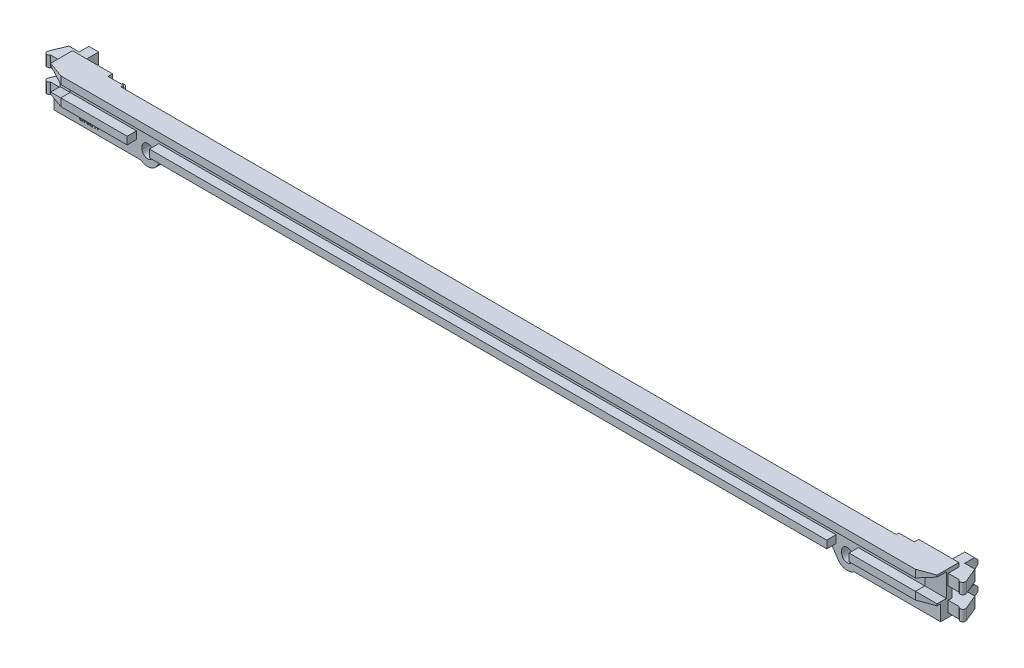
from build123d import *
from OCP.BRepFilletAPI import BRepFilletAPI_MakeChamfer

# Parameters (mm, degrees)
EXTRUDE_1_DEPTH     = 2.5
SKETCH_3_W          = 199.3
SKETCH_3_H          = 1.7
SKETCH_3_W_2        = 18.5
SKETCH_3_W_3        = 152.3
EXTRUDE_2_DEPTH     = 2.1
SKETCH_4_W          = 25.216666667
SKETCH_4_H          = 3.1
SKETCH_4_W_2        = 25.216666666
CUT_EXTRUDE_1_DEPTH = 1.6
EXTRUDE_3_DEPTH     = 2.45
SKETCH_6_W          = 12.5
SKETCH_6_H          = 1.5
SKETCH_6_H_2        = 1.4
EXTRUDE_4_DEPTH     = 0.6
SKETCH_7_W          = 9
SKETCH_7_H          = 1.5
SKETCH_7_H_2        = 1.4
EXTRUDE_5_DEPTH     = 1
CHAMFER_1_SIZE      = 1.3
CHAMFER_1_SIZE2     = 3.571720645
CHAMFER_2_SIZE      = 0.8
EXTRUDE_6_DEPTH     = 1.5
CUT_EXTRUDE_2_DEPTH = 0.2


with BuildPart() as part:
    # Sketch 1 → Extrude 1 (new body)
    with BuildSketch(Plane.XY):
        with BuildLine():
            Line((-73.042304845, -1.25), (73.042304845, -1.25))
            ThreePointArc((73.042304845, -1.25), (74.459347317, -1.60576275), (75.540302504, -2.588672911))
            Line((75.540302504, -2.588672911), (76.568335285, -4.134439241))
            ThreePointArc((76.568335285, -4.134439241), (78.226547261, -5.213876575), (80.15, -4.75))
            Line((80.15, -4.75), (99.65, -4.75))
            Line((99.65, -4.75), (99.65, 4.75))
            Line((99.65, 4.75), (-99.65, 4.75))
            Line((-99.65, 4.75), (-99.65, -4.75))
            Line((-99.65, -4.75), (-80.15, -4.75))
            ThreePointArc((-80.15, -4.75), (-78.226547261, -5.213876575), (-76.568335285, -4.134439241))
            Line((-76.568335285, -4.134439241), (-75.540302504, -2.588672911))
            ThreePointArc((-75.540302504, -2.588672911), (-74.459347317, -1.60576275), (-73.042304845, -1.25))
        make_face()
        with BuildLine():
            Line((-77.4, -2), (-77.4, -2.5))
            ThreePointArc((-77.4, -2.5), (-78.65, -3.75), (-79.9, -2.5))
            Line((-79.9, -2.5), (-79.9, -2))
            ThreePointArc((-79.9, -2), (-78.65, -0.75), (-77.4, -2))
        make_face(mode=Mode.SUBTRACT)
        with BuildLine():
            Line((77.4, -2), (77.4, -2.5))
            ThreePointArc((77.4, -2.5), (78.65, -3.75), (79.9, -2.5))
            Line((79.9, -2.5), (79.9, -2))
            ThreePointArc((79.9, -2), (78.65, -0.75), (77.4, -2))
        make_face(mode=Mode.SUBTRACT)
    extrude(amount=EXTRUDE_1_DEPTH)

    # Sketch 3 → Extrude 2 (add)
    with BuildSketch(Plane.XY.offset(2.5)):
        with Locations((0, 3.9)):
            Rectangle(SKETCH_3_W, SKETCH_3_H)
        with Locations((-90.4, -0.4)):
            Rectangle(SKETCH_3_W_2, SKETCH_3_H)
        with Locations((90.4, -0.4)):
            Rectangle(SKETCH_3_W_2, SKETCH_3_H)
        with Locations((0, -0.4)):
            Rectangle(SKETCH_3_W_3, SKETCH_3_H)
    extrude(amount=EXTRUDE_2_DEPTH)

    # Sketch 4 → Cut-Extrude 1 (cut)
    with BuildSketch(Plane(origin=(0, 0, 0), x_dir=(-1, 0, 0), z_dir=(0, 0, -1))):
        with Locations((-65.541666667, 1.7)):
            Rectangle(SKETCH_4_W, SKETCH_4_H)
        with Locations((-39.325, 1.7)):
            Rectangle(SKETCH_4_W_2, SKETCH_4_H)
        with Locations((-13.108333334, 1.7)):
            Rectangle(SKETCH_4_W, SKETCH_4_H)
        with Locations((13.108333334, 1.7)):
            Rectangle(SKETCH_4_W, SKETCH_4_H)
        with Locations((39.325, 1.7)):
            Rectangle(SKETCH_4_W_2, SKETCH_4_H)
        with Locations((65.541666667, 1.7)):
            Rectangle(SKETCH_4_W, SKETCH_4_H)
        with BuildLine():
            Line((80.9, -3.35), (97.45, -3.35))
            Line((97.45, -3.35), (97.45, 3.25))
            Line((97.45, 3.25), (79.15, 3.25))
            Line((79.15, 3.25), (79.15, 0.193741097))
            ThreePointArc((79.15, 0.193741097), (80.40890591, -0.59687848), (80.9, -2))
            Line((80.9, -2), (80.9, -3.35))
        make_face()
        with BuildLine():
            Line((-80.9, -3.35), (-97.45, -3.35))
            Line((-97.45, -3.35), (-97.45, 3.25))
            Line((-97.45, 3.25), (-79.15, 3.25))
            Line((-79.15, 3.25), (-79.15, 0.193741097))
            ThreePointArc((-79.15, 0.193741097), (-80.40890591, -0.59687848), (-80.9, -2))
            Line((-80.9, -2), (-80.9, -3.35))
        make_face()
    extrude(amount=-CUT_EXTRUDE_1_DEPTH, mode=Mode.SUBTRACT)

    # Sketch 5 → Extrude 3 (add)
    with BuildSketch(Plane(origin=(0, 3.85, 0), x_dir=(1, 0, 0), z_dir=(0, 1, 0))):
        with BuildLine():
            Line((97.35, 0), (99.65, 0))
            Line((99.65, 0), (99.65, -0.8))
            Line((99.65, -0.8), (102.130384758, -0.8))
            ThreePointArc((102.130384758, -0.8), (102.915351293, -1.038134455), (103.204346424, -0.270435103))
            Line((103.204346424, -0.270435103), (101.85, 3))
            Line((101.85, 3), (99.55, 3))
            Line((99.55, 3), (99.55, 6))
            Line((99.55, 6), (97.35, 6))
            Line((97.35, 6), (97.35, 0))
        make_face()
        with BuildLine():
            Line((-97.35, 6), (-97.35, 0))
            Line((-97.35, 0), (-99.65, 0))
            Line((-99.65, 0), (-99.65, -0.8))
            Line((-99.65, -0.8), (-102.130384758, -0.8))
            ThreePointArc((-102.130384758, -0.8), (-102.915351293, -1.038134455), (-103.204346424, -0.270435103))
            Line((-103.204346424, -0.270435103), (-101.85, 3))
            Line((-101.85, 3), (-99.55, 3))
            Line((-99.55, 3), (-99.55, 6))
            Line((-99.55, 6), (-97.35, 6))
        make_face()
    extrude_3 = extrude(amount=-EXTRUDE_3_DEPTH)

    # Mirror 1: Extrude 3 across plane
    add(extrude_3.mirror(Plane.ZX))

    # Sketch 6 → Extrude 4 (add)
    with BuildSketch(Plane(origin=(0, 0, 0), x_dir=(-1, 0, 0), z_dir=(0, 0, -1))):
        with Locations((93.4, 4)):
            Rectangle(SKETCH_6_W, SKETCH_6_H)
        with Locations((93.4, -4.05)):
            Rectangle(SKETCH_6_W, SKETCH_6_H_2)
        with Locations((-93.4, 4)):
            Rectangle(SKETCH_6_W, SKETCH_6_H)
        with Locations((-93.4, -4.05)):
            Rectangle(SKETCH_6_W, SKETCH_6_H_2)
    extrude(amount=EXTRUDE_4_DEPTH)

    # Sketch 7 → Extrude 5 (add)
    with BuildSketch(Plane(origin=(0, 0, -0.6), x_dir=(-1, 0, 0), z_dir=(0, 0, -1))):
        with Locations((-95.15, 4)):
            Rectangle(SKETCH_7_W, SKETCH_7_H)
        with Locations((-95.15, -4.05)):
            Rectangle(SKETCH_7_W, SKETCH_7_H_2)
        with Locations((95.15, 4)):
            Rectangle(SKETCH_7_W, SKETCH_7_H)
        with Locations((95.15, -4.05)):
            Rectangle(SKETCH_7_W, SKETCH_7_H_2)
    extrude(amount=EXTRUDE_5_DEPTH)

    # Chamfer 1: one chamfer whose edges measure the first distance from different faces: ONE call of the kernel's chamfer builder (chamfer() names one face for all edges)
    chamfer_1_edges_1 = [part.edges().sort_by_distance(p)[0] for p in [
        (99.65, 3.9, 4.6),
        (99.65, -0.4, 4.6),
        (99.65, 3.05, 3.55),
        (99.65, 1.75, 2.5),
        (99.65, 0.45, 3.55),
    ]]
    chamfer_1_side_1 = [part.faces().sort_by_distance(p)[0] for p in [
        (99.65, 0.418592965, 1.7139866),
    ]]
    chamfer_1_edges_2 = [part.edges().sort_by_distance(p)[0] for p in [
        (-99.65, -0.4, 4.6),
        (-99.65, 0.45, 3.55),
        (-99.65, 1.75, 2.5),
        (-99.65, 3.05, 3.55),
        (-99.65, 3.9, 4.6),
    ]]
    chamfer_1_side_2 = [part.faces().sort_by_distance(p)[0] for p in [
        (-99.65, 0.418592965, 1.7139866),
    ]]
    chamfer_1 = BRepFilletAPI_MakeChamfer(part.part.solid().wrapped)
    for e in chamfer_1_edges_1:
        chamfer_1.Add(CHAMFER_1_SIZE, CHAMFER_1_SIZE2, e.wrapped, chamfer_1_side_1[0].wrapped)  # the first distance lies on this face
    for e in chamfer_1_edges_2:
        chamfer_1.Add(CHAMFER_1_SIZE, CHAMFER_1_SIZE2, e.wrapped, chamfer_1_side_2[0].wrapped)  # the first distance lies on this face
    add(Compound.cast(chamfer_1.Shape()), mode=Mode.REPLACE)

    # Chamfer 2
    chamfer_2_edges = [part.edges().sort_by_distance(p)[0] for p in [
        (98.45, 1.4, -6),
        (97.35, 2.625, -6),
        (98.45, 3.85, -6),
        (-98.45, 1.4, -6),
        (-97.35, 2.625, -6),
        (-98.45, 3.85, -6),
        (97.35, -2.625, -6),
        (98.45, -3.85, -6),
        (98.45, -1.4, -6),
        (-98.45, -3.85, -6),
        (-97.35, -2.625, -6),
        (-98.45, -1.4, -6),
    ]]
    chamfer(chamfer_2_edges, length=CHAMFER_2_SIZE)

    # Sketch 9 → Extrude 6 (add, symmetric)
    with BuildSketch(Plane(origin=(0, 0, 0), x_dir=(1, 0, 0), z_dir=(0, 1, 0))):
        Polygon((-90.9, 4.1), (-90.9, -1.6), (-88.9, -1.6), (-89.589745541, 3.307794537), (-90.2, 4.1), align=None)
        Polygon((90.2, 4.1), (89.589745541, 3.307794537), (88.9, -1.6), (90.9, -1.6), (90.9, 4.1), align=None)
    extrude(amount=EXTRUDE_6_DEPTH, both=True)

    # Sketch 10 → Cut-Extrude 2 (cut)
    # profile 1 of 4: a face of its own
    with BuildSketch(Plane.XY.offset(2.5)):
        with BuildLine():
            add(Edge.make_bspline(
                [(-94.062280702, -3.048245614), (-94.061924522, -3.015099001), (-94.061237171, -2.951133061), (-94.05550418, -2.858834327), (-94.045523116, -2.773794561), (-94.031723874, -2.695953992), (-94.014105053, -2.625270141), (-93.992363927, -2.56184921), (-93.967019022, -2.505454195), (-93.9366888, -2.456510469), (-93.903076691, -2.414008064), (-93.866292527, -2.377064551), (-93.826295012, -2.345760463), (-93.783064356, -2.320161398), (-93.73670486, -2.300514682), (-93.687261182, -2.286598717), (-93.634598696, -2.277954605), (-93.598376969, -2.276870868), (-93.579824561, -2.276315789)],
                knots=[0, 0, 0, 0, 1.545771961, 2.983012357, 4.310477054, 5.53694469, 6.667573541, 7.704171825, 8.660118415, 9.544545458, 10.382225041, 11.182194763, 11.970229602, 12.744599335, 13.518524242, 14.311480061, 15.135156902, 16, 16, 16, 16], degree=3))
            add(Edge.make_bspline(
                [(-93.579824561, -2.276315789), (-93.561271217, -2.276866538), (-93.525047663, -2.277941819), (-93.472192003, -2.286680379), (-93.422314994, -2.300520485), (-93.375360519, -2.320066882), (-93.331689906, -2.345838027), (-93.291076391, -2.377127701), (-93.253330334, -2.413956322), (-93.218750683, -2.456464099), (-93.187423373, -2.505388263), (-93.161109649, -2.561799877), (-93.138316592, -2.625175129), (-93.120056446, -2.695900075), (-93.106008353, -2.773787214), (-93.095699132, -2.858823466), (-93.089549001, -2.951121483), (-93.08892158, -3.015097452), (-93.088596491, -3.048245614)],
                knots=[0, 0, 0, 0, 0.860780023, 1.68058719, 2.479491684, 3.259041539, 4.034105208, 4.82638745, 5.633332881, 6.476525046, 7.364812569, 8.322660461, 9.359409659, 10.487238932, 11.708844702, 13.030675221, 14.461490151, 16, 16, 16, 16], degree=3))
            add(Edge.make_bspline(
                [(-93.088596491, -3.048245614), (-93.088919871, -3.081393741), (-93.08954294, -3.14526158), (-93.095692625, -3.237345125), (-93.106024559, -3.322051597), (-93.119957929, -3.3994278), (-93.138370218, -3.46947173), (-93.161112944, -3.532100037), (-93.187337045, -3.587823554), (-93.218765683, -3.63583649), (-93.253345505, -3.677373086), (-93.291097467, -3.713236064), (-93.331802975, -3.743526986), (-93.37545781, -3.768592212), (-93.422322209, -3.787894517), (-93.472246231, -3.801253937), (-93.525031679, -3.810209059), (-93.56126754, -3.810998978), (-93.579824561, -3.811403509)],
                knots=[0, 0, 0, 0, 1.548230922, 2.98303917, 4.308200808, 5.532550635, 6.652834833, 7.686623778, 8.641401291, 9.522543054, 10.35935634, 11.160886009, 11.949022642, 12.72391454, 13.50644669, 14.309045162, 15.13403228, 16, 16, 16, 16], degree=3))
            add(Edge.make_bspline(
                [(-93.579824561, -3.811403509), (-93.598380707, -3.810994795), (-93.634614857, -3.810196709), (-93.68720608, -3.801334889), (-93.736697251, -3.787900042), (-93.782968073, -3.768499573), (-93.826179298, -3.743604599), (-93.866269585, -3.713299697), (-93.903062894, -3.677321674), (-93.936675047, -3.635790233), (-93.967104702, -3.587754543), (-93.992360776, -3.532050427), (-94.014053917, -3.469376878), (-94.031819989, -3.399372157), (-94.045507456, -3.322044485), (-94.055510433, -3.237334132), (-94.061242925, -3.145249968), (-94.061926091, -3.081392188), (-94.062280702, -3.048245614)],
                knots=[0, 0, 0, 0, 0.870119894, 1.699062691, 2.495710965, 3.272607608, 4.046805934, 4.830589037, 5.624963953, 6.456101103, 7.333244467, 8.286074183, 9.319696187, 10.442778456, 11.672084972, 13.002989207, 14.444345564, 16, 16, 16, 16], degree=3))
        make_face()
        with BuildLine():
            add(Edge.make_bspline(
                [(-93.851754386, -3.048245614), (-93.851496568, -3.077597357), (-93.851003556, -3.133725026), (-93.847547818, -3.213924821), (-93.841576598, -3.28625356), (-93.832840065, -3.35065551), (-93.822202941, -3.407323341), (-93.808651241, -3.45592553), (-93.793123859, -3.496865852), (-93.774216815, -3.530056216), (-93.753349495, -3.557193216), (-93.732129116, -3.580679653), (-93.709495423, -3.600514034), (-93.685570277, -3.616412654), (-93.660884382, -3.629439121), (-93.634733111, -3.638076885), (-93.607707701, -3.644005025), (-93.58917037, -3.644491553), (-93.579824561, -3.644736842)],
                knots=[0, 0, 0, 0, 1.935009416, 3.700208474, 5.290966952, 6.717666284, 7.983429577, 9.088666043, 10.040575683, 10.86236036, 11.596304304, 12.29363804, 12.946461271, 13.574167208, 14.184039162, 14.780089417, 15.384968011, 16, 16, 16, 16], degree=3))
            add(Edge.make_bspline(
                [(-93.579824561, -3.644736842), (-93.570479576, -3.644485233), (-93.551837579, -3.643983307), (-93.524598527, -3.638073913), (-93.498115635, -3.629456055), (-93.473059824, -3.61633162), (-93.448527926, -3.60055661), (-93.425243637, -3.580612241), (-93.403047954, -3.557243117), (-93.381206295, -3.530122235), (-93.361292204, -3.496954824), (-93.344787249, -3.455987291), (-93.33019069, -3.407413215), (-93.318929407, -3.350698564), (-93.309951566, -3.28626065), (-93.303649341, -3.213933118), (-93.29978116, -3.133733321), (-93.299348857, -3.077598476), (-93.299122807, -3.048245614)],
                knots=[0, 0, 0, 0, 0.611201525, 1.219265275, 1.81832141, 2.430716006, 3.066343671, 3.725874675, 4.433422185, 5.175826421, 6.003240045, 6.957248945, 8.061566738, 9.322244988, 10.74103478, 12.322506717, 14.077041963, 16, 16, 16, 16], degree=3))
            add(Edge.make_bspline(
                [(-93.299122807, -3.048245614), (-93.299351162, -3.018892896), (-93.299788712, -2.962650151), (-93.303643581, -2.882232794), (-93.309984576, -2.809478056), (-93.318894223, -2.74459831), (-93.330232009, -2.687358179), (-93.344868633, -2.638167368), (-93.361276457, -2.596307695), (-93.381337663, -2.562181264), (-93.402836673, -2.533807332), (-93.425241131, -2.50972186), (-93.448619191, -2.489203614), (-93.472850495, -2.47228677), (-93.498125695, -2.458990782), (-93.524529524, -2.449859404), (-93.551858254, -2.444170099), (-93.570484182, -2.443379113), (-93.579824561, -2.442982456)],
                knots=[0, 0, 0, 0, 1.905496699, 3.651122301, 5.225236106, 6.645066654, 7.901182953, 9.008941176, 9.973772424, 10.81182905, 11.569731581, 12.281072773, 12.943777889, 13.585412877, 14.195455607, 14.791357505, 15.393899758, 16, 16, 16, 16], degree=3))
            add(Edge.make_bspline(
                [(-93.579824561, -2.442982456), (-93.589165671, -2.44337305), (-93.607686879, -2.444147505), (-93.634802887, -2.449857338), (-93.660873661, -2.459007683), (-93.685784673, -2.472208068), (-93.709401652, -2.489244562), (-93.73213411, -2.509654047), (-93.753556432, -2.533866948), (-93.77408503, -2.562240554), (-93.793138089, -2.59639566), (-93.808573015, -2.638225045), (-93.822164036, -2.687446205), (-93.832873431, -2.744641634), (-93.841544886, -2.809484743), (-93.847553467, -2.882241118), (-93.85099648, -2.962658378), (-93.851494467, -3.018893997), (-93.851754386, -3.048245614)],
                knots=[0, 0, 0, 0, 0.609805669, 1.209100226, 1.80197336, 2.409477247, 3.043460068, 3.699626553, 4.401016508, 5.150948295, 5.983648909, 6.946538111, 8.055194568, 9.316215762, 10.743762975, 12.326884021, 14.082853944, 16, 16, 16, 16], degree=3))
        make_face(mode=Mode.SUBTRACT)
    # profile 2 of 4: a face of its own
    with BuildSketch(Plane.XY.offset(2.5)):
        Polygon((-92.904385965, -2.293859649), (-92.685087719, -2.293859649), (-92.202631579, -3.381578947), (-92.193859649, -3.381578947), (-92.193859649, -2.293859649), (-91.992105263, -2.293859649), (-91.992105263, -3.793859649), (-92.211403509, -3.793859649), (-92.693859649, -2.706140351), (-92.702631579, -2.706140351), (-92.702631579, -3.793859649), (-92.904385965, -3.793859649), align=None)
    # profile 3 of 4: a face of its own
    with BuildSketch(Plane.XY.offset(2.5)):
        with BuildLine():
            add(Edge.make_bspline(
                [(-91.816666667, -3.048245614), (-91.816310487, -3.015099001), (-91.815623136, -2.951133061), (-91.809890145, -2.858834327), (-91.799909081, -2.773794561), (-91.786109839, -2.695953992), (-91.768491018, -2.625270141), (-91.746749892, -2.56184921), (-91.721404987, -2.505454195), (-91.691074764, -2.456510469), (-91.657462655, -2.414008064), (-91.620678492, -2.377064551), (-91.580680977, -2.345760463), (-91.53745032, -2.320161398), (-91.491090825, -2.300514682), (-91.441647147, -2.286598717), (-91.388984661, -2.277954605), (-91.352762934, -2.276870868), (-91.334210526, -2.276315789)],
                knots=[0, 0, 0, 0, 1.545771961, 2.983012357, 4.310477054, 5.53694469, 6.667573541, 7.704171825, 8.660118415, 9.544545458, 10.382225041, 11.182194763, 11.970229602, 12.744599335, 13.518524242, 14.311480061, 15.135156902, 16, 16, 16, 16], degree=3))
            add(Edge.make_bspline(
                [(-91.334210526, -2.276315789), (-91.315657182, -2.276866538), (-91.279433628, -2.277941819), (-91.226577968, -2.286680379), (-91.176700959, -2.300520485), (-91.129746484, -2.320066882), (-91.086075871, -2.345838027), (-91.045462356, -2.377127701), (-91.007716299, -2.413956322), (-90.973136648, -2.456464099), (-90.941809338, -2.505388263), (-90.915495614, -2.561799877), (-90.892702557, -2.625175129), (-90.874442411, -2.695900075), (-90.860394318, -2.773787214), (-90.850085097, -2.858823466), (-90.843934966, -2.951121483), (-90.843307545, -3.015097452), (-90.842982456, -3.048245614)],
                knots=[0, 0, 0, 0, 0.860780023, 1.68058719, 2.479491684, 3.259041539, 4.034105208, 4.82638745, 5.633332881, 6.476525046, 7.364812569, 8.322660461, 9.359409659, 10.487238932, 11.708844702, 13.030675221, 14.461490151, 16, 16, 16, 16], degree=3))
            add(Edge.make_bspline(
                [(-90.842982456, -3.048245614), (-90.843305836, -3.081393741), (-90.843928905, -3.14526158), (-90.850078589, -3.237345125), (-90.860410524, -3.322051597), (-90.874343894, -3.3994278), (-90.892756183, -3.46947173), (-90.915498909, -3.532100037), (-90.94172301, -3.587823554), (-90.973151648, -3.63583649), (-91.00773147, -3.677373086), (-91.045483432, -3.713236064), (-91.08618894, -3.743526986), (-91.129843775, -3.768592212), (-91.176708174, -3.787894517), (-91.226632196, -3.801253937), (-91.279417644, -3.810209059), (-91.315653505, -3.810998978), (-91.334210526, -3.811403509)],
                knots=[0, 0, 0, 0, 1.548230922, 2.98303917, 4.308200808, 5.532550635, 6.652834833, 7.686623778, 8.641401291, 9.522543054, 10.35935634, 11.160886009, 11.949022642, 12.72391454, 13.50644669, 14.309045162, 15.13403228, 16, 16, 16, 16], degree=3))
            add(Edge.make_bspline(
                [(-91.334210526, -3.811403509), (-91.352766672, -3.810994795), (-91.389000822, -3.810196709), (-91.441592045, -3.801334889), (-91.491083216, -3.787900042), (-91.537354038, -3.768499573), (-91.580565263, -3.743604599), (-91.62065555, -3.713299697), (-91.657448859, -3.677321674), (-91.691061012, -3.635790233), (-91.721490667, -3.587754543), (-91.746746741, -3.532050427), (-91.768439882, -3.469376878), (-91.786205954, -3.399372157), (-91.79989342, -3.322044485), (-91.809896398, -3.237334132), (-91.81562889, -3.145249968), (-91.816312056, -3.081392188), (-91.816666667, -3.048245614)],
                knots=[0, 0, 0, 0, 0.870119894, 1.699062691, 2.495710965, 3.272607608, 4.046805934, 4.830589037, 5.624963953, 6.456101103, 7.333244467, 8.286074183, 9.319696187, 10.442778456, 11.672084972, 13.002989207, 14.444345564, 16, 16, 16, 16], degree=3))
        make_face()
        with BuildLine():
            add(Edge.make_bspline(
                [(-91.606140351, -3.048245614), (-91.605882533, -3.077597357), (-91.605389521, -3.133725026), (-91.601933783, -3.213924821), (-91.595962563, -3.28625356), (-91.58722603, -3.35065551), (-91.576588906, -3.407323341), (-91.563037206, -3.45592553), (-91.547509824, -3.496865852), (-91.52860278, -3.530056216), (-91.50773546, -3.557193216), (-91.486515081, -3.580679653), (-91.463881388, -3.600514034), (-91.439956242, -3.616412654), (-91.415270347, -3.629439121), (-91.389119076, -3.638076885), (-91.362093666, -3.644005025), (-91.343556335, -3.644491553), (-91.334210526, -3.644736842)],
                knots=[0, 0, 0, 0, 1.935009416, 3.700208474, 5.290966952, 6.717666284, 7.983429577, 9.088666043, 10.040575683, 10.86236036, 11.596304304, 12.29363804, 12.946461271, 13.574167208, 14.184039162, 14.780089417, 15.384968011, 16, 16, 16, 16], degree=3))
            add(Edge.make_bspline(
                [(-91.334210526, -3.644736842), (-91.324865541, -3.644485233), (-91.306223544, -3.643983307), (-91.278984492, -3.638073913), (-91.252501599, -3.629456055), (-91.227445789, -3.61633162), (-91.202913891, -3.60055661), (-91.179629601, -3.580612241), (-91.157433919, -3.557243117), (-91.13559226, -3.530122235), (-91.115678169, -3.496954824), (-91.099173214, -3.455987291), (-91.084576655, -3.407413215), (-91.073315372, -3.350698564), (-91.064337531, -3.28626065), (-91.058035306, -3.213933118), (-91.054167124, -3.133733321), (-91.053734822, -3.077598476), (-91.053508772, -3.048245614)],
                knots=[0, 0, 0, 0, 0.611201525, 1.219265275, 1.81832141, 2.430716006, 3.066343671, 3.725874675, 4.433422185, 5.175826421, 6.003240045, 6.957248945, 8.061566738, 9.322244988, 10.74103478, 12.322506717, 14.077041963, 16, 16, 16, 16], degree=3))
            add(Edge.make_bspline(
                [(-91.053508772, -3.048245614), (-91.053737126, -3.018892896), (-91.054174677, -2.962650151), (-91.058029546, -2.882232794), (-91.064370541, -2.809478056), (-91.073280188, -2.74459831), (-91.084617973, -2.687358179), (-91.099254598, -2.638167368), (-91.115662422, -2.596307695), (-91.135723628, -2.562181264), (-91.157222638, -2.533807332), (-91.179627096, -2.50972186), (-91.203005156, -2.489203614), (-91.22723646, -2.47228677), (-91.25251166, -2.458990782), (-91.278915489, -2.449859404), (-91.306244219, -2.444170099), (-91.324870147, -2.443379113), (-91.334210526, -2.442982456)],
                knots=[0, 0, 0, 0, 1.905496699, 3.651122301, 5.225236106, 6.645066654, 7.901182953, 9.008941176, 9.973772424, 10.81182905, 11.569731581, 12.281072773, 12.943777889, 13.585412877, 14.195455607, 14.791357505, 15.393899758, 16, 16, 16, 16], degree=3))
            add(Edge.make_bspline(
                [(-91.334210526, -2.442982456), (-91.343551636, -2.44337305), (-91.362072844, -2.444147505), (-91.389188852, -2.449857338), (-91.415259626, -2.459007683), (-91.440170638, -2.472208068), (-91.463787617, -2.489244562), (-91.486520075, -2.509654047), (-91.507942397, -2.533866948), (-91.528470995, -2.562240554), (-91.547524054, -2.59639566), (-91.56295898, -2.638225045), (-91.576550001, -2.687446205), (-91.587259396, -2.744641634), (-91.595930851, -2.809484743), (-91.601939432, -2.882241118), (-91.605382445, -2.962658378), (-91.605880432, -3.018893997), (-91.606140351, -3.048245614)],
                knots=[0, 0, 0, 0, 0.609805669, 1.209100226, 1.80197336, 2.409477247, 3.043460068, 3.699626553, 4.401016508, 5.150948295, 5.983648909, 6.946538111, 8.055194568, 9.316215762, 10.743762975, 12.326884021, 14.082853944, 16, 16, 16, 16], degree=3))
        make_face(mode=Mode.SUBTRACT)
    # profile 4 of 4: a face of its own
    with BuildSketch(Plane.XY.offset(2.5)):
        Polygon((-90.728947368, -2.293859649), (-90.500877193, -2.293859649), (-90.097368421, -3.039473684), (-89.957017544, -2.855263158), (-89.957017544, -2.293859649), (-89.755263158, -2.293859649), (-89.755263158, -3.793859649), (-89.957017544, -3.793859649), (-89.957017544, -3.144736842), (-90.457017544, -3.793859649), (-90.693859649, -3.793859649), (-90.228947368, -3.206140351), align=None)
    extrude(amount=-CUT_EXTRUDE_2_DEPTH, mode=Mode.SUBTRACT)


solid = part.part
